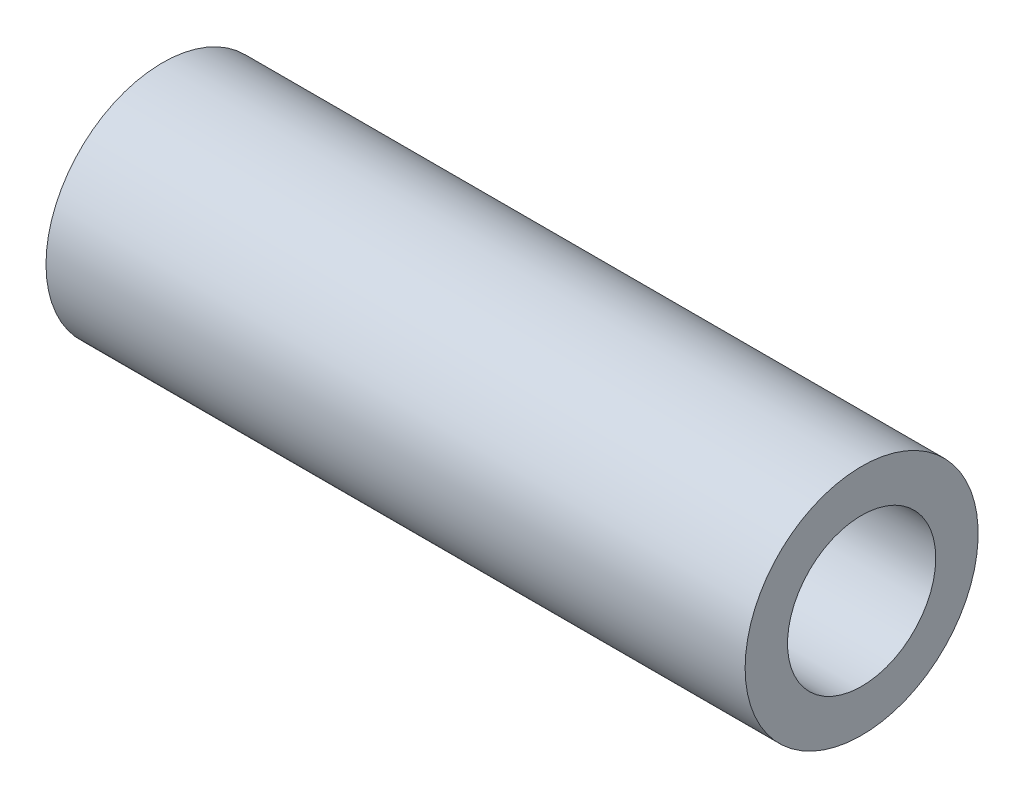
from build123d import *

# Parameters (mm, degrees)
SKETCH2_R           = 3.175
BOSS_EXTRUDE1_DEPTH = 9.525
SKETCH3_R           = 2.0193
CUT_EXTRUDE1_DEPTH  = 20.572014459


with BuildPart() as part:
    # Sketch2 → Boss-Extrude1 (new, symmetric)
    with BuildSketch(Plane(origin=(0, 0, 0), x_dir=(0, 0, -1), z_dir=(1, 0, 0))):
        with Locations(Location((0, 0, 0), (0, 0, 180))):
            Circle(SKETCH2_R)
    extrude(amount=BOSS_EXTRUDE1_DEPTH, both=True)

    # Sketch3 → Cut-Extrude1 (cut, through all)
    with BuildSketch(Plane(origin=(9.525, 0, 0), x_dir=(0, 0, -1), z_dir=(1, 0, 0))):
        Circle(SKETCH3_R)
    extrude(amount=-CUT_EXTRUDE1_DEPTH, mode=Mode.SUBTRACT)


solid = part.part
